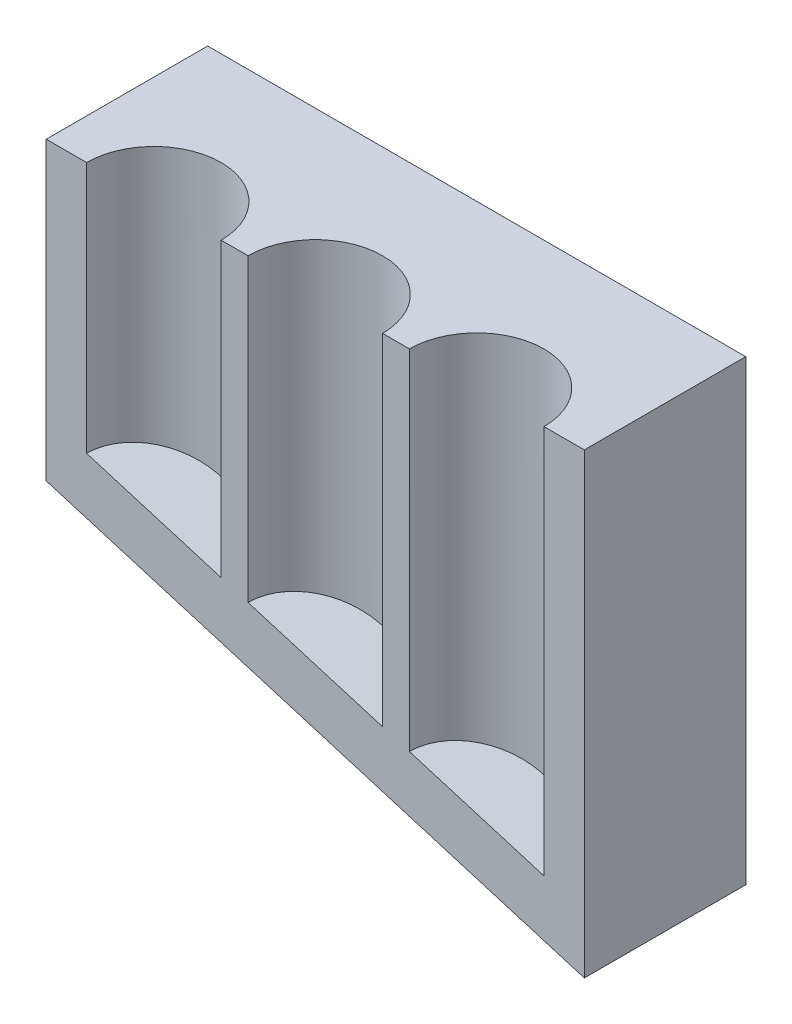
ISO-10303-21;
HEADER;
FILE_DESCRIPTION(('STEP AP214'),'2;1');
FILE_NAME('part.step','',(''),(''),'','','');
FILE_SCHEMA(('AUTOMOTIVE_DESIGN { 1 0 10303 214 1 1 1 1 }'));
ENDSEC;
DATA;
#1=APPLICATION_CONTEXT('core data for automotive mechanical design processes');
#2=APPLICATION_PROTOCOL_DEFINITION('international standard','automotive_design',2000,#1);
#3=PRODUCT_CONTEXT('',#1,'mechanical');
#4=PRODUCT('Part','Part','',(#3));
#5=PRODUCT_RELATED_PRODUCT_CATEGORY('part','',(#4));
#6=PRODUCT_DEFINITION_FORMATION('','',#4);
#7=PRODUCT_DEFINITION_CONTEXT('part definition',#1,'design');
#8=PRODUCT_DEFINITION('design','',#6,#7);
#9=PRODUCT_DEFINITION_SHAPE('','',#8);
#10=(LENGTH_UNIT() NAMED_UNIT(*) SI_UNIT(.MILLI.,.METRE.));
#11=(NAMED_UNIT(*) PLANE_ANGLE_UNIT() SI_UNIT($,.RADIAN.));
#12=(NAMED_UNIT(*) SI_UNIT($,.STERADIAN.) SOLID_ANGLE_UNIT());
#13=UNCERTAINTY_MEASURE_WITH_UNIT(LENGTH_MEASURE(1.E-05),#10,'distance_accuracy_value','');
#14=(GEOMETRIC_REPRESENTATION_CONTEXT(3) GLOBAL_UNCERTAINTY_ASSIGNED_CONTEXT((#13)) GLOBAL_UNIT_ASSIGNED_CONTEXT((#10,
#11,#12)) REPRESENTATION_CONTEXT('',''));
#15=CARTESIAN_POINT('',(0.,0.,0.));
#16=DIRECTION('',(0.,0.,1.));
#17=DIRECTION('',(1.,0.,0.));
#18=AXIS2_PLACEMENT_3D('',#15,#16,#17);
#19=CARTESIAN_POINT('',(0.,0.,30.));
#20=DIRECTION('',(1.,0.,0.));
#21=DIRECTION('',(0.,0.,-1.));
#22=AXIS2_PLACEMENT_3D('',#19,#20,#21);
#23=PLANE('',#22);
#24=DIRECTION('',(0.,-1.,0.));
#25=VECTOR('',#24,1.);
#26=CARTESIAN_POINT('',(0.,0.,0.));
#27=LINE('',#26,#25);
#28=CARTESIAN_POINT('',(0.,55.,0.));
#29=VERTEX_POINT('',#28);
#30=CARTESIAN_POINT('',(0.,0.,0.));
#31=VERTEX_POINT('',#30);
#32=EDGE_CURVE('E159',#29,#31,#27,.T.);
#33=ORIENTED_EDGE('',*,*,#32,.T.);
#34=DIRECTION('',(0.,0.,-1.));
#35=VECTOR('',#34,1.);
#36=CARTESIAN_POINT('',(0.,0.,30.));
#37=LINE('',#36,#35);
#38=CARTESIAN_POINT('',(0.,0.,30.));
#39=VERTEX_POINT('',#38);
#40=EDGE_CURVE('E140',#39,#31,#37,.T.);
#41=ORIENTED_EDGE('',*,*,#40,.F.);
#42=DIRECTION('',(0.,-1.,0.));
#43=VECTOR('',#42,1.);
#44=CARTESIAN_POINT('',(0.,0.,30.));
#45=LINE('',#44,#43);
#46=CARTESIAN_POINT('',(0.,55.,30.));
#47=VERTEX_POINT('',#46);
#48=EDGE_CURVE('E154',#47,#39,#45,.T.);
#49=ORIENTED_EDGE('',*,*,#48,.F.);
#50=DIRECTION('',(0.,0.,-1.));
#51=VECTOR('',#50,1.);
#52=CARTESIAN_POINT('',(0.,55.,30.));
#53=LINE('',#52,#51);
#54=EDGE_CURVE('E149',#47,#29,#53,.T.);
#55=ORIENTED_EDGE('',*,*,#54,.T.);
#56=EDGE_LOOP('',(#33,#41,#49,#55));
#57=FACE_BOUND('',#56,.T.);
#58=ADVANCED_FACE('F34',(#57),#23,.F.);
#59=CARTESIAN_POINT('',(0.,0.,30.));
#60=DIRECTION('',(0.287347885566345,0.957826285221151,0.));
#61=DIRECTION('',(-0.957826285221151,0.287347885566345,0.));
#62=AXIS2_PLACEMENT_3D('',#59,#60,#61);
#63=PLANE('',#62);
#64=DIRECTION('',(0.957826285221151,-0.287347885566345,0.));
#65=VECTOR('',#64,1.);
#66=CARTESIAN_POINT('',(0.,0.,0.));
#67=LINE('',#66,#65);
#68=CARTESIAN_POINT('',(100.,-30.,0.));
#69=VERTEX_POINT('',#68);
#70=EDGE_CURVE('E157',#31,#69,#67,.T.);
#71=ORIENTED_EDGE('',*,*,#70,.T.);
#72=DIRECTION('',(0.,0.,-1.));
#73=VECTOR('',#72,1.);
#74=CARTESIAN_POINT('',(100.,-30.,30.));
#75=LINE('',#74,#73);
#76=CARTESIAN_POINT('',(100.,-30.,30.));
#77=VERTEX_POINT('',#76);
#78=EDGE_CURVE('E143',#77,#69,#75,.T.);
#79=ORIENTED_EDGE('',*,*,#78,.F.);
#80=DIRECTION('',(0.957826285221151,-0.287347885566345,0.));
#81=VECTOR('',#80,1.);
#82=CARTESIAN_POINT('',(0.,0.,30.));
#83=LINE('',#82,#81);
#84=EDGE_CURVE('E168',#39,#77,#83,.T.);
#85=ORIENTED_EDGE('',*,*,#84,.F.);
#86=ORIENTED_EDGE('',*,*,#40,.T.);
#87=EDGE_LOOP('',(#71,#79,#85,#86));
#88=FACE_BOUND('',#87,.T.);
#89=ADVANCED_FACE('F197',(#88),#63,.F.);
#90=CARTESIAN_POINT('',(100.,-30.,30.));
#91=DIRECTION('',(-1.,0.,0.));
#92=DIRECTION('',(0.,0.,1.));
#93=AXIS2_PLACEMENT_3D('',#90,#91,#92);
#94=PLANE('',#93);
#95=DIRECTION('',(0.,1.,0.));
#96=VECTOR('',#95,1.);
#97=CARTESIAN_POINT('',(100.,-30.,0.));
#98=LINE('',#97,#96);
#99=CARTESIAN_POINT('',(100.,55.,0.));
#100=VERTEX_POINT('',#99);
#101=EDGE_CURVE('E155',#69,#100,#98,.T.);
#102=ORIENTED_EDGE('',*,*,#101,.T.);
#103=DIRECTION('',(0.,0.,-1.));
#104=VECTOR('',#103,1.);
#105=CARTESIAN_POINT('',(100.,55.,30.));
#106=LINE('',#105,#104);
#107=CARTESIAN_POINT('',(100.,55.,30.));
#108=VERTEX_POINT('',#107);
#109=EDGE_CURVE('E146',#108,#100,#106,.T.);
#110=ORIENTED_EDGE('',*,*,#109,.F.);
#111=DIRECTION('',(0.,1.,0.));
#112=VECTOR('',#111,1.);
#113=CARTESIAN_POINT('',(100.,-30.,30.));
#114=LINE('',#113,#112);
#115=EDGE_CURVE('E166',#77,#108,#114,.T.);
#116=ORIENTED_EDGE('',*,*,#115,.F.);
#117=ORIENTED_EDGE('',*,*,#78,.T.);
#118=EDGE_LOOP('',(#102,#110,#116,#117));
#119=FACE_BOUND('',#118,.T.);
#120=ADVANCED_FACE('F202',(#119),#94,.F.);
#121=CARTESIAN_POINT('',(0.,55.,30.));
#122=DIRECTION('',(0.,-1.,0.));
#123=DIRECTION('',(0.,0.,-1.));
#124=AXIS2_PLACEMENT_3D('',#121,#122,#123);
#125=PLANE('',#124);
#126=DIRECTION('',(-1.,0.,0.));
#127=VECTOR('',#126,1.);
#128=CARTESIAN_POINT('',(0.,55.,30.));
#129=LINE('',#128,#127);
#130=CARTESIAN_POINT('',(67.5,55.,30.));
#131=VERTEX_POINT('',#130);
#132=CARTESIAN_POINT('',(62.5,55.,30.));
#133=VERTEX_POINT('',#132);
#134=EDGE_CURVE('E164',#131,#133,#129,.T.);
#135=ORIENTED_EDGE('',*,*,#134,.F.);
#136=CARTESIAN_POINT('',(80.,55.,30.));
#137=DIRECTION('',(0.,1.,0.));
#138=DIRECTION('',(0.,0.,1.));
#139=AXIS2_PLACEMENT_3D('',#136,#137,#138);
#140=CIRCLE('',#139,12.5);
#141=CARTESIAN_POINT('',(92.5,55.,30.));
#142=VERTEX_POINT('',#141);
#143=EDGE_CURVE('E118',#142,#131,#140,.T.);
#144=ORIENTED_EDGE('',*,*,#143,.F.);
#145=EDGE_CURVE('E123',#108,#142,#129,.T.);
#146=ORIENTED_EDGE('',*,*,#145,.F.);
#147=ORIENTED_EDGE('',*,*,#109,.T.);
#148=DIRECTION('',(-1.,0.,0.));
#149=VECTOR('',#148,1.);
#150=CARTESIAN_POINT('',(0.,55.,0.));
#151=LINE('',#150,#149);
#152=EDGE_CURVE('E152',#100,#29,#151,.T.);
#153=ORIENTED_EDGE('',*,*,#152,.T.);
#154=ORIENTED_EDGE('',*,*,#54,.F.);
#155=CARTESIAN_POINT('',(7.50000000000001,55.,30.));
#156=VERTEX_POINT('',#155);
#157=EDGE_CURVE('E165',#156,#47,#129,.T.);
#158=ORIENTED_EDGE('',*,*,#157,.F.);
#159=CARTESIAN_POINT('',(20.,55.,30.));
#160=DIRECTION('',(0.,1.,0.));
#161=DIRECTION('',(0.,0.,1.));
#162=AXIS2_PLACEMENT_3D('',#159,#160,#161);
#163=CIRCLE('',#162,12.5);
#164=CARTESIAN_POINT('',(32.5,55.,30.));
#165=VERTEX_POINT('',#164);
#166=EDGE_CURVE('E174',#165,#156,#163,.T.);
#167=ORIENTED_EDGE('',*,*,#166,.F.);
#168=CARTESIAN_POINT('',(37.5,55.,30.));
#169=VERTEX_POINT('',#168);
#170=EDGE_CURVE('E184',#169,#165,#129,.T.);
#171=ORIENTED_EDGE('',*,*,#170,.F.);
#172=CARTESIAN_POINT('',(50.,55.,30.));
#173=DIRECTION('',(0.,1.,0.));
#174=DIRECTION('',(0.,0.,1.));
#175=AXIS2_PLACEMENT_3D('',#172,#173,#174);
#176=CIRCLE('',#175,12.5);
#177=EDGE_CURVE('E117',#133,#169,#176,.T.);
#178=ORIENTED_EDGE('',*,*,#177,.F.);
#179=EDGE_LOOP('',(#135,#144,#146,#147,#153,#154,#158,#167,#171,#178));
#180=FACE_BOUND('',#179,.T.);
#181=ADVANCED_FACE('F182',(#180),#125,.F.);
#182=CARTESIAN_POINT('',(0.,55.,30.));
#183=DIRECTION('',(0.,0.,-1.));
#184=DIRECTION('',(-1.,0.,0.));
#185=AXIS2_PLACEMENT_3D('',#182,#183,#184);
#186=PLANE('',#185);
#187=DIRECTION('',(0.957826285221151,-0.287347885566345,0.));
#188=VECTOR('',#187,1.);
#189=CARTESIAN_POINT('',(-12.2641358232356,14.1195472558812,30.));
#190=LINE('',#189,#188);
#191=CARTESIAN_POINT('',(67.5,-9.80969349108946,30.));
#192=VERTEX_POINT('',#191);
#193=CARTESIAN_POINT('',(92.5,-17.3096934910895,30.));
#194=VERTEX_POINT('',#193);
#195=EDGE_CURVE('E108',#192,#194,#190,.T.);
#196=ORIENTED_EDGE('',*,*,#195,.F.);
#197=DIRECTION('',(0.,1.,0.));
#198=VECTOR('',#197,1.);
#199=CARTESIAN_POINT('',(67.5,-59.6933918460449,30.));
#200=LINE('',#199,#198);
#201=EDGE_CURVE('E12',#192,#131,#200,.T.);
#202=ORIENTED_EDGE('',*,*,#201,.T.);
#203=ORIENTED_EDGE('',*,*,#134,.T.);
#204=DIRECTION('',(0.,1.,0.));
#205=VECTOR('',#204,1.);
#206=CARTESIAN_POINT('',(62.5,-50.6933918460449,30.));
#207=LINE('',#206,#205);
#208=CARTESIAN_POINT('',(62.5,-8.30969349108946,30.));
#209=VERTEX_POINT('',#208);
#210=EDGE_CURVE('E127',#133,#209,#207,.F.);
#211=ORIENTED_EDGE('',*,*,#210,.T.);
#212=DIRECTION('',(0.957826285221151,-0.287347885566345,0.));
#213=VECTOR('',#212,1.);
#214=CARTESIAN_POINT('',(-12.2641358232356,14.1195472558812,30.));
#215=LINE('',#214,#213);
#216=CARTESIAN_POINT('',(37.5,-0.809693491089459,30.));
#217=VERTEX_POINT('',#216);
#218=EDGE_CURVE('E130',#217,#209,#215,.T.);
#219=ORIENTED_EDGE('',*,*,#218,.F.);
#220=DIRECTION('',(0.,1.,0.));
#221=VECTOR('',#220,1.);
#222=CARTESIAN_POINT('',(37.5,-50.6933918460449,30.));
#223=LINE('',#222,#221);
#224=EDGE_CURVE('E112',#217,#169,#223,.T.);
#225=ORIENTED_EDGE('',*,*,#224,.T.);
#226=ORIENTED_EDGE('',*,*,#170,.T.);
#227=DIRECTION('',(0.,1.,0.));
#228=VECTOR('',#227,1.);
#229=CARTESIAN_POINT('',(32.5,-41.6933918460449,30.));
#230=LINE('',#229,#228);
#231=CARTESIAN_POINT('',(32.5,0.690306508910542,30.));
#232=VERTEX_POINT('',#231);
#233=EDGE_CURVE('E135',#165,#232,#230,.F.);
#234=ORIENTED_EDGE('',*,*,#233,.T.);
#235=DIRECTION('',(0.957826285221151,-0.287347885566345,0.));
#236=VECTOR('',#235,1.);
#237=CARTESIAN_POINT('',(-12.2641358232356,14.1195472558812,30.));
#238=LINE('',#237,#236);
#239=CARTESIAN_POINT('',(7.50000000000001,8.19030650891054,30.));
#240=VERTEX_POINT('',#239);
#241=EDGE_CURVE('E138',#240,#232,#238,.T.);
#242=ORIENTED_EDGE('',*,*,#241,.F.);
#243=DIRECTION('',(0.,1.,0.));
#244=VECTOR('',#243,1.);
#245=CARTESIAN_POINT('',(7.50000000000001,-41.6933918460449,30.));
#246=LINE('',#245,#244);
#247=EDGE_CURVE('E132',#240,#156,#246,.T.);
#248=ORIENTED_EDGE('',*,*,#247,.T.);
#249=ORIENTED_EDGE('',*,*,#157,.T.);
#250=ORIENTED_EDGE('',*,*,#48,.T.);
#251=ORIENTED_EDGE('',*,*,#84,.T.);
#252=ORIENTED_EDGE('',*,*,#115,.T.);
#253=ORIENTED_EDGE('',*,*,#145,.T.);
#254=DIRECTION('',(0.,1.,0.));
#255=VECTOR('',#254,1.);
#256=CARTESIAN_POINT('',(92.5,-59.6933918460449,30.));
#257=LINE('',#256,#255);
#258=EDGE_CURVE('E41',#142,#194,#257,.F.);
#259=ORIENTED_EDGE('',*,*,#258,.T.);
#260=EDGE_LOOP('',(#196,#202,#203,#211,#219,#225,#226,#234,#242,#248,#249,#250,#251,#252,#253,#259));
#261=FACE_BOUND('',#260,.T.);
#262=ADVANCED_FACE('F121',(#261),#186,.F.);
#263=CARTESIAN_POINT('',(0.,55.,0.));
#264=DIRECTION('',(0.,0.,-1.));
#265=DIRECTION('',(-1.,0.,0.));
#266=AXIS2_PLACEMENT_3D('',#263,#264,#265);
#267=PLANE('',#266);
#268=ORIENTED_EDGE('',*,*,#32,.F.);
#269=ORIENTED_EDGE('',*,*,#152,.F.);
#270=ORIENTED_EDGE('',*,*,#101,.F.);
#271=ORIENTED_EDGE('',*,*,#70,.F.);
#272=EDGE_LOOP('',(#268,#269,#270,#271));
#273=FACE_BOUND('',#272,.T.);
#274=ADVANCED_FACE('F205',(#273),#267,.T.);
#275=CARTESIAN_POINT('',(20.,-41.6933918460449,30.));
#276=DIRECTION('',(0.,1.,0.));
#277=DIRECTION('',(0.,0.,1.));
#278=AXIS2_PLACEMENT_3D('',#275,#276,#277);
#279=CYLINDRICAL_SURFACE('',#278,12.5);
#280=CARTESIAN_POINT('',(20.,4.44030650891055,30.));
#281=DIRECTION('',(0.287347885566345,0.957826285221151,0.));
#282=DIRECTION('',(-0.957826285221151,0.287347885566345,0.));
#283=AXIS2_PLACEMENT_3D('',#280,#281,#282);
#284=ELLIPSE('',#283,13.0503831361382,12.5);
#285=EDGE_CURVE('E162',#240,#232,#284,.F.);
#286=ORIENTED_EDGE('',*,*,#285,.T.);
#287=ORIENTED_EDGE('',*,*,#233,.F.);
#288=ORIENTED_EDGE('',*,*,#166,.T.);
#289=ORIENTED_EDGE('',*,*,#247,.F.);
#290=EDGE_LOOP('',(#286,#287,#288,#289));
#291=FACE_BOUND('',#290,.T.);
#292=ADVANCED_FACE('F207',(#291),#279,.F.);
#293=CARTESIAN_POINT('',(2.87347885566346,9.57826285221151,30.));
#294=DIRECTION('',(0.287347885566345,0.957826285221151,0.));
#295=DIRECTION('',(-0.957826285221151,0.287347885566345,0.));
#296=AXIS2_PLACEMENT_3D('',#293,#294,#295);
#297=PLANE('',#296);
#298=ORIENTED_EDGE('',*,*,#241,.T.);
#299=ORIENTED_EDGE('',*,*,#285,.F.);
#300=EDGE_LOOP('',(#298,#299));
#301=FACE_BOUND('',#300,.T.);
#302=ADVANCED_FACE('F213',(#301),#297,.T.);
#303=CARTESIAN_POINT('',(50.,-50.6933918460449,30.));
#304=DIRECTION('',(0.,1.,0.));
#305=DIRECTION('',(0.,0.,1.));
#306=AXIS2_PLACEMENT_3D('',#303,#304,#305);
#307=CYLINDRICAL_SURFACE('',#306,12.5);
#308=CARTESIAN_POINT('',(50.,-4.55969349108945,30.));
#309=DIRECTION('',(0.287347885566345,0.957826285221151,0.));
#310=DIRECTION('',(-0.957826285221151,0.287347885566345,0.));
#311=AXIS2_PLACEMENT_3D('',#308,#309,#310);
#312=ELLIPSE('',#311,13.0503831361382,12.5);
#313=EDGE_CURVE('E54',#217,#209,#312,.F.);
#314=ORIENTED_EDGE('',*,*,#313,.T.);
#315=ORIENTED_EDGE('',*,*,#210,.F.);
#316=ORIENTED_EDGE('',*,*,#177,.T.);
#317=ORIENTED_EDGE('',*,*,#224,.F.);
#318=EDGE_LOOP('',(#314,#315,#316,#317));
#319=FACE_BOUND('',#318,.T.);
#320=ADVANCED_FACE('F242',(#319),#307,.F.);
#321=CARTESIAN_POINT('',(2.87347885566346,9.57826285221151,30.));
#322=DIRECTION('',(0.287347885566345,0.957826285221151,0.));
#323=DIRECTION('',(-0.957826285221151,0.287347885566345,0.));
#324=AXIS2_PLACEMENT_3D('',#321,#322,#323);
#325=PLANE('',#324);
#326=ORIENTED_EDGE('',*,*,#218,.T.);
#327=ORIENTED_EDGE('',*,*,#313,.F.);
#328=EDGE_LOOP('',(#326,#327));
#329=FACE_BOUND('',#328,.T.);
#330=ADVANCED_FACE('F247',(#329),#325,.T.);
#331=CARTESIAN_POINT('',(80.,-59.6933918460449,30.));
#332=DIRECTION('',(0.,1.,0.));
#333=DIRECTION('',(0.,0.,1.));
#334=AXIS2_PLACEMENT_3D('',#331,#332,#333);
#335=CYLINDRICAL_SURFACE('',#334,12.5);
#336=CARTESIAN_POINT('',(80.,-13.5596934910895,30.));
#337=DIRECTION('',(0.287347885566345,0.957826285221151,0.));
#338=DIRECTION('',(-0.957826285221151,0.287347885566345,0.));
#339=AXIS2_PLACEMENT_3D('',#336,#337,#338);
#340=ELLIPSE('',#339,13.0503831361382,12.5);
#341=EDGE_CURVE('E47',#192,#194,#340,.F.);
#342=ORIENTED_EDGE('',*,*,#341,.T.);
#343=ORIENTED_EDGE('',*,*,#258,.F.);
#344=ORIENTED_EDGE('',*,*,#143,.T.);
#345=ORIENTED_EDGE('',*,*,#201,.F.);
#346=EDGE_LOOP('',(#342,#343,#344,#345));
#347=FACE_BOUND('',#346,.T.);
#348=ADVANCED_FACE('F115',(#347),#335,.F.);
#349=CARTESIAN_POINT('',(2.87347885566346,9.57826285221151,30.));
#350=DIRECTION('',(0.287347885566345,0.957826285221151,0.));
#351=DIRECTION('',(-0.957826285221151,0.287347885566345,0.));
#352=AXIS2_PLACEMENT_3D('',#349,#350,#351);
#353=PLANE('',#352);
#354=ORIENTED_EDGE('',*,*,#195,.T.);
#355=ORIENTED_EDGE('',*,*,#341,.F.);
#356=EDGE_LOOP('',(#354,#355));
#357=FACE_BOUND('',#356,.T.);
#358=ADVANCED_FACE('F109',(#357),#353,.T.);
#359=CLOSED_SHELL('',(#58,#89,#120,#181,#262,#274,#292,#302,#320,#330,#348,#358));
#360=MANIFOLD_SOLID_BREP('B2',#359);
#361=ADVANCED_BREP_SHAPE_REPRESENTATION('',(#18,#360),#14);
#362=SHAPE_DEFINITION_REPRESENTATION(#9,#361);
ENDSEC;
END-ISO-10303-21;
